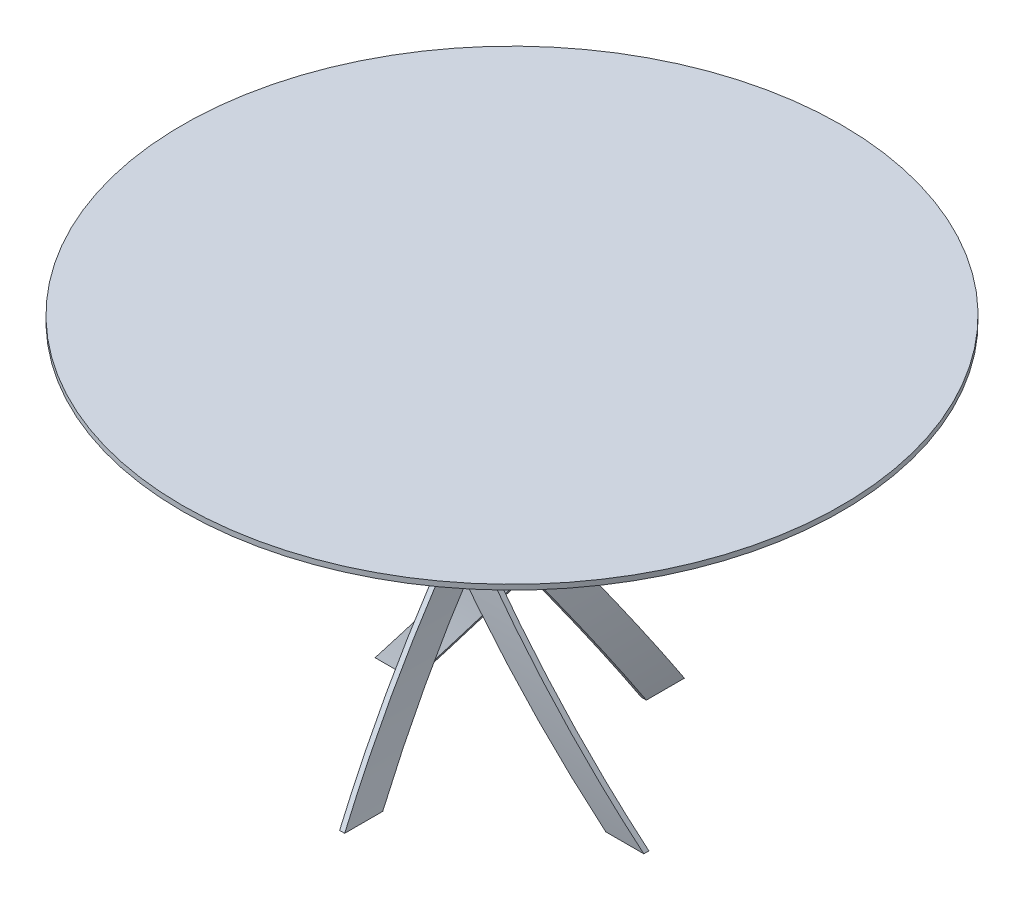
ISO-10303-21;
HEADER;
FILE_DESCRIPTION(('STEP AP214'),'2;1');
FILE_NAME('part.step','',(''),(''),'','','');
FILE_SCHEMA(('AUTOMOTIVE_DESIGN { 1 0 10303 214 1 1 1 1 }'));
ENDSEC;
DATA;
#1=APPLICATION_CONTEXT('core data for automotive mechanical design processes');
#2=APPLICATION_PROTOCOL_DEFINITION('international standard','automotive_design',2000,#1);
#3=PRODUCT_CONTEXT('',#1,'mechanical');
#4=PRODUCT('Part','Part','',(#3));
#5=PRODUCT_RELATED_PRODUCT_CATEGORY('part','',(#4));
#6=PRODUCT_DEFINITION_FORMATION('','',#4);
#7=PRODUCT_DEFINITION_CONTEXT('part definition',#1,'design');
#8=PRODUCT_DEFINITION('design','',#6,#7);
#9=PRODUCT_DEFINITION_SHAPE('','',#8);
#10=(LENGTH_UNIT() NAMED_UNIT(*) SI_UNIT(.MILLI.,.METRE.));
#11=(NAMED_UNIT(*) PLANE_ANGLE_UNIT() SI_UNIT($,.RADIAN.));
#12=(NAMED_UNIT(*) SI_UNIT($,.STERADIAN.) SOLID_ANGLE_UNIT());
#13=UNCERTAINTY_MEASURE_WITH_UNIT(LENGTH_MEASURE(1.E-05),#10,'distance_accuracy_value','');
#14=(GEOMETRIC_REPRESENTATION_CONTEXT(3) GLOBAL_UNCERTAINTY_ASSIGNED_CONTEXT((#13)) GLOBAL_UNIT_ASSIGNED_CONTEXT((#10,
#11,#12)) REPRESENTATION_CONTEXT('',''));
#15=CARTESIAN_POINT('',(0.,0.,0.));
#16=DIRECTION('',(0.,0.,1.));
#17=DIRECTION('',(1.,0.,0.));
#18=AXIS2_PLACEMENT_3D('',#15,#16,#17);
#19=CARTESIAN_POINT('',(-300.000000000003,-1.11022302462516E-13,299.999999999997));
#20=DIRECTION('',(0.,0.589469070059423,0.807790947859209));
#21=DIRECTION('',(0.,-0.807790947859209,0.589469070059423));
#22=AXIS2_PLACEMENT_3D('',#19,#20,#21);
#23=PLANE('',#22);
#24=DIRECTION('',(1.,0.,0.));
#25=VECTOR('',#24,1.);
#26=CARTESIAN_POINT('',(-299.999999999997,740.,-240.000000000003));
#27=LINE('',#26,#25);
#28=CARTESIAN_POINT('',(-39.9999999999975,740.,-240.));
#29=VERTEX_POINT('',#28);
#30=CARTESIAN_POINT('',(-29.9999999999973,740.,-240.));
#31=VERTEX_POINT('',#30);
#32=EDGE_CURVE('E109',#29,#31,#27,.T.);
#33=ORIENTED_EDGE('',*,*,#32,.F.);
#34=CARTESIAN_POINT('',(1721.56180703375,370.,30.0000000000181));
#35=DIRECTION('',(0.,0.589469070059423,0.807790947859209));
#36=DIRECTION('',(0.,0.807790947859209,-0.589469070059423));
#37=AXIS2_PLACEMENT_3D('',#34,#35,#36);
#38=ELLIPSE('',#37,2228.29929546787,1800.);
#39=CARTESIAN_POINT('',(-40.0000000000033,-1.11022302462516E-13,300.));
#40=VERTEX_POINT('',#39);
#41=EDGE_CURVE('E91',#29,#40,#38,.T.);
#42=ORIENTED_EDGE('',*,*,#41,.T.);
#43=DIRECTION('',(1.,0.,0.));
#44=VECTOR('',#43,1.);
#45=CARTESIAN_POINT('',(-300.000000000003,-1.11022302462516E-13,299.999999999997));
#46=LINE('',#45,#44);
#47=CARTESIAN_POINT('',(-30.0000000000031,-1.11022302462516E-13,300.));
#48=VERTEX_POINT('',#47);
#49=EDGE_CURVE('E111',#40,#48,#46,.T.);
#50=ORIENTED_EDGE('',*,*,#49,.T.);
#51=CARTESIAN_POINT('',(1731.56180703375,370.,30.0000000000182));
#52=DIRECTION('',(0.,0.589469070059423,0.807790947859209));
#53=DIRECTION('',(0.,0.807790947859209,-0.589469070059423));
#54=AXIS2_PLACEMENT_3D('',#51,#52,#53);
#55=ELLIPSE('',#54,2228.29929546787,1800.);
#56=EDGE_CURVE('E96',#48,#31,#55,.F.);
#57=ORIENTED_EDGE('',*,*,#56,.T.);
#58=EDGE_LOOP('',(#33,#42,#50,#57));
#59=FACE_BOUND('',#58,.T.);
#60=ADVANCED_FACE('F46',(#59),#23,.T.);
#61=CARTESIAN_POINT('',(1721.56180703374,370.,500.000000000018));
#62=DIRECTION('',(0.,0.,-1.));
#63=DIRECTION('',(-1.,0.,0.));
#64=AXIS2_PLACEMENT_3D('',#61,#62,#63);
#65=CYLINDRICAL_SURFACE('',#64,1800.);
#66=ORIENTED_EDGE('',*,*,#41,.F.);
#67=CARTESIAN_POINT('',(1721.56180703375,370.,-239.999999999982));
#68=DIRECTION('',(0.,0.,-1.));
#69=DIRECTION('',(0.,1.,0.));
#70=AXIS2_PLACEMENT_3D('',#67,#68,#69);
#71=CIRCLE('',#70,1800.);
#72=CARTESIAN_POINT('',(-58.4922044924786,637.222222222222,-240.000000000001));
#73=VERTEX_POINT('',#72);
#74=EDGE_CURVE('E87',#73,#29,#71,.T.);
#75=ORIENTED_EDGE('',*,*,#74,.F.);
#76=CARTESIAN_POINT('',(1721.56180703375,370.,-44.9999999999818));
#77=DIRECTION('',(0.,-0.589469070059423,-0.807790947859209));
#78=DIRECTION('',(0.,0.807790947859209,-0.589469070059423));
#79=AXIS2_PLACEMENT_3D('',#76,#77,#78);
#80=ELLIPSE('',#79,2228.29929546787,1800.);
#81=CARTESIAN_POINT('',(-40.0000000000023,-1.11022302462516E-13,225.));
#82=VERTEX_POINT('',#81);
#83=EDGE_CURVE('E50',#82,#73,#80,.T.);
#84=ORIENTED_EDGE('',*,*,#83,.F.);
#85=DIRECTION('',(0.,0.,-1.));
#86=VECTOR('',#85,1.);
#87=CARTESIAN_POINT('',(-40.0000000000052,0.,500.));
#88=LINE('',#87,#86);
#89=EDGE_CURVE('E70',#40,#82,#88,.T.);
#90=ORIENTED_EDGE('',*,*,#89,.F.);
#91=EDGE_LOOP('',(#66,#75,#84,#90));
#92=FACE_BOUND('',#91,.T.);
#93=ADVANCED_FACE('F89',(#92),#65,.T.);
#94=CARTESIAN_POINT('',(-299.999999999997,637.222222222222,-240.000000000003));
#95=DIRECTION('',(0.,-0.589469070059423,-0.807790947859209));
#96=DIRECTION('',(0.,0.807790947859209,-0.589469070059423));
#97=AXIS2_PLACEMENT_3D('',#94,#95,#96);
#98=PLANE('',#97);
#99=DIRECTION('',(1.,0.,0.));
#100=VECTOR('',#99,1.);
#101=CARTESIAN_POINT('',(-300.000000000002,-1.11022302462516E-13,224.999999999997));
#102=LINE('',#101,#100);
#103=CARTESIAN_POINT('',(-30.0000000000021,-1.11022302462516E-13,225.));
#104=VERTEX_POINT('',#103);
#105=EDGE_CURVE('E12',#82,#104,#102,.T.);
#106=ORIENTED_EDGE('',*,*,#105,.F.);
#107=ORIENTED_EDGE('',*,*,#83,.T.);
#108=DIRECTION('',(1.,0.,0.));
#109=VECTOR('',#108,1.);
#110=CARTESIAN_POINT('',(-299.999999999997,637.222222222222,-240.000000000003));
#111=LINE('',#110,#109);
#112=CARTESIAN_POINT('',(-48.4922044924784,637.222222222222,-240.));
#113=VERTEX_POINT('',#112);
#114=EDGE_CURVE('E55',#73,#113,#111,.T.);
#115=ORIENTED_EDGE('',*,*,#114,.T.);
#116=CARTESIAN_POINT('',(1731.56180703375,370.,-44.9999999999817));
#117=DIRECTION('',(0.,-0.589469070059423,-0.807790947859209));
#118=DIRECTION('',(0.,0.807790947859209,-0.589469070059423));
#119=AXIS2_PLACEMENT_3D('',#116,#117,#118);
#120=ELLIPSE('',#119,2228.29929546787,1800.);
#121=EDGE_CURVE('E101',#113,#104,#120,.F.);
#122=ORIENTED_EDGE('',*,*,#121,.T.);
#123=EDGE_LOOP('',(#106,#107,#115,#122));
#124=FACE_BOUND('',#123,.T.);
#125=ADVANCED_FACE('F48',(#124),#98,.T.);
#126=CARTESIAN_POINT('',(-299.999999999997,740.,-240.000000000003));
#127=DIRECTION('',(0.,0.,-1.));
#128=DIRECTION('',(0.,1.,0.));
#129=AXIS2_PLACEMENT_3D('',#126,#127,#128);
#130=PLANE('',#129);
#131=ORIENTED_EDGE('',*,*,#114,.F.);
#132=ORIENTED_EDGE('',*,*,#74,.T.);
#133=ORIENTED_EDGE('',*,*,#32,.T.);
#134=CARTESIAN_POINT('',(1731.56180703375,370.,-239.999999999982));
#135=DIRECTION('',(0.,0.,-1.));
#136=DIRECTION('',(0.,1.,0.));
#137=AXIS2_PLACEMENT_3D('',#134,#135,#136);
#138=CIRCLE('',#137,1800.);
#139=EDGE_CURVE('E97',#31,#113,#138,.F.);
#140=ORIENTED_EDGE('',*,*,#139,.T.);
#141=EDGE_LOOP('',(#131,#132,#133,#140));
#142=FACE_BOUND('',#141,.T.);
#143=ADVANCED_FACE('F102',(#142),#130,.T.);
#144=CARTESIAN_POINT('',(1731.56180703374,370.,500.000000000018));
#145=DIRECTION('',(0.,0.,-1.));
#146=DIRECTION('',(-1.,0.,0.));
#147=AXIS2_PLACEMENT_3D('',#144,#145,#146);
#148=CYLINDRICAL_SURFACE('',#147,1800.);
#149=ORIENTED_EDGE('',*,*,#56,.F.);
#150=DIRECTION('',(0.,0.,-1.));
#151=VECTOR('',#150,1.);
#152=CARTESIAN_POINT('',(-30.0000000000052,0.,500.));
#153=LINE('',#152,#151);
#154=EDGE_CURVE('E62',#48,#104,#153,.T.);
#155=ORIENTED_EDGE('',*,*,#154,.T.);
#156=ORIENTED_EDGE('',*,*,#121,.F.);
#157=ORIENTED_EDGE('',*,*,#139,.F.);
#158=EDGE_LOOP('',(#149,#155,#156,#157));
#159=FACE_BOUND('',#158,.T.);
#160=ADVANCED_FACE('F122',(#159),#148,.F.);
#161=CARTESIAN_POINT('',(-300.000000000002,-1.11022302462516E-13,224.999999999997));
#162=DIRECTION('',(0.,-1.,0.));
#163=DIRECTION('',(-1.,0.,0.));
#164=AXIS2_PLACEMENT_3D('',#161,#162,#163);
#165=PLANE('',#164);
#166=ORIENTED_EDGE('',*,*,#49,.F.);
#167=ORIENTED_EDGE('',*,*,#89,.T.);
#168=ORIENTED_EDGE('',*,*,#105,.T.);
#169=ORIENTED_EDGE('',*,*,#154,.F.);
#170=EDGE_LOOP('',(#166,#167,#168,#169));
#171=FACE_BOUND('',#170,.T.);
#172=ADVANCED_FACE('F119',(#171),#165,.T.);
#173=CLOSED_SHELL('',(#60,#93,#125,#143,#160,#172));
#174=MANIFOLD_SOLID_BREP('B2',#173);
#175=CARTESIAN_POINT('',(300.,-1.11022302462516E-13,300.));
#176=DIRECTION('',(0.807790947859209,0.589469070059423,0.));
#177=DIRECTION('',(0.589469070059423,-0.807790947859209,0.));
#178=AXIS2_PLACEMENT_3D('',#175,#176,#177);
#179=PLANE('',#178);
#180=DIRECTION('',(0.,0.,-1.));
#181=VECTOR('',#180,1.);
#182=CARTESIAN_POINT('',(-240.,740.,300.));
#183=LINE('',#182,#181);
#184=CARTESIAN_POINT('',(-240.,740.,40.));
#185=VERTEX_POINT('',#184);
#186=CARTESIAN_POINT('',(-240.,740.,29.9999999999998));
#187=VERTEX_POINT('',#186);
#188=EDGE_CURVE('E255',#185,#187,#183,.T.);
#189=ORIENTED_EDGE('',*,*,#188,.F.);
#190=CARTESIAN_POINT('',(30.,370.,-1721.56180703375));
#191=DIRECTION('',(0.807790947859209,0.589469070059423,0.));
#192=DIRECTION('',(-0.589469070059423,0.807790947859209,0.));
#193=AXIS2_PLACEMENT_3D('',#190,#191,#192);
#194=ELLIPSE('',#193,2228.29929546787,1800.);
#195=CARTESIAN_POINT('',(300.,-1.11022302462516E-13,40.0000000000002));
#196=VERTEX_POINT('',#195);
#197=EDGE_CURVE('E237',#185,#196,#194,.T.);
#198=ORIENTED_EDGE('',*,*,#197,.T.);
#199=DIRECTION('',(0.,0.,-1.));
#200=VECTOR('',#199,1.);
#201=CARTESIAN_POINT('',(300.,-1.11022302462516E-13,300.));
#202=LINE('',#201,#200);
#203=CARTESIAN_POINT('',(300.,-1.11022302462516E-13,30.));
#204=VERTEX_POINT('',#203);
#205=EDGE_CURVE('E257',#196,#204,#202,.T.);
#206=ORIENTED_EDGE('',*,*,#205,.T.);
#207=CARTESIAN_POINT('',(30.,370.,-1731.56180703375));
#208=DIRECTION('',(0.807790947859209,0.589469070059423,0.));
#209=DIRECTION('',(-0.589469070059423,0.807790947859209,0.));
#210=AXIS2_PLACEMENT_3D('',#207,#208,#209);
#211=ELLIPSE('',#210,2228.29929546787,1800.);
#212=EDGE_CURVE('E242',#204,#187,#211,.F.);
#213=ORIENTED_EDGE('',*,*,#212,.T.);
#214=EDGE_LOOP('',(#189,#198,#206,#213));
#215=FACE_BOUND('',#214,.T.);
#216=ADVANCED_FACE('F192',(#215),#179,.T.);
#217=CARTESIAN_POINT('',(500.,370.,-1721.56180703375));
#218=DIRECTION('',(-1.,0.,0.));
#219=DIRECTION('',(0.,0.,1.));
#220=AXIS2_PLACEMENT_3D('',#217,#218,#219);
#221=CYLINDRICAL_SURFACE('',#220,1800.);
#222=ORIENTED_EDGE('',*,*,#197,.F.);
#223=CARTESIAN_POINT('',(-240.,370.,-1721.56180703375));
#224=DIRECTION('',(-1.,0.,0.));
#225=DIRECTION('',(0.,1.,0.));
#226=AXIS2_PLACEMENT_3D('',#223,#224,#225);
#227=CIRCLE('',#226,1800.);
#228=CARTESIAN_POINT('',(-240.,637.222222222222,58.4922044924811));
#229=VERTEX_POINT('',#228);
#230=EDGE_CURVE('E233',#229,#185,#227,.T.);
#231=ORIENTED_EDGE('',*,*,#230,.F.);
#232=CARTESIAN_POINT('',(-44.9999999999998,370.,-1721.56180703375));
#233=DIRECTION('',(-0.807790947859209,-0.589469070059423,0.));
#234=DIRECTION('',(-0.589469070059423,0.807790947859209,0.));
#235=AXIS2_PLACEMENT_3D('',#232,#233,#234);
#236=ELLIPSE('',#235,2228.29929546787,1800.);
#237=CARTESIAN_POINT('',(225.,-1.11022302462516E-13,40.));
#238=VERTEX_POINT('',#237);
#239=EDGE_CURVE('E196',#238,#229,#236,.T.);
#240=ORIENTED_EDGE('',*,*,#239,.F.);
#241=DIRECTION('',(-1.,0.,0.));
#242=VECTOR('',#241,1.);
#243=CARTESIAN_POINT('',(500.,0.,40.));
#244=LINE('',#243,#242);
#245=EDGE_CURVE('E216',#196,#238,#244,.T.);
#246=ORIENTED_EDGE('',*,*,#245,.F.);
#247=EDGE_LOOP('',(#222,#231,#240,#246));
#248=FACE_BOUND('',#247,.T.);
#249=ADVANCED_FACE('F235',(#248),#221,.T.);
#250=CARTESIAN_POINT('',(-240.,637.222222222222,300.));
#251=DIRECTION('',(-0.807790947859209,-0.589469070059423,0.));
#252=DIRECTION('',(-0.589469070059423,0.807790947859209,0.));
#253=AXIS2_PLACEMENT_3D('',#250,#251,#252);
#254=PLANE('',#253);
#255=DIRECTION('',(0.,0.,-1.));
#256=VECTOR('',#255,1.);
#257=CARTESIAN_POINT('',(225.,-1.11022302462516E-13,300.));
#258=LINE('',#257,#256);
#259=CARTESIAN_POINT('',(225.,-1.11022302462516E-13,29.9999999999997));
#260=VERTEX_POINT('',#259);
#261=EDGE_CURVE('E44',#238,#260,#258,.T.);
#262=ORIENTED_EDGE('',*,*,#261,.F.);
#263=ORIENTED_EDGE('',*,*,#239,.T.);
#264=DIRECTION('',(0.,0.,-1.));
#265=VECTOR('',#264,1.);
#266=CARTESIAN_POINT('',(-240.,637.222222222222,300.));
#267=LINE('',#266,#265);
#268=CARTESIAN_POINT('',(-240.,637.222222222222,48.4922044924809));
#269=VERTEX_POINT('',#268);
#270=EDGE_CURVE('E201',#229,#269,#267,.T.);
#271=ORIENTED_EDGE('',*,*,#270,.T.);
#272=CARTESIAN_POINT('',(-44.9999999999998,370.,-1731.56180703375));
#273=DIRECTION('',(-0.807790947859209,-0.589469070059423,0.));
#274=DIRECTION('',(-0.589469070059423,0.807790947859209,0.));
#275=AXIS2_PLACEMENT_3D('',#272,#273,#274);
#276=ELLIPSE('',#275,2228.29929546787,1800.);
#277=EDGE_CURVE('E247',#269,#260,#276,.F.);
#278=ORIENTED_EDGE('',*,*,#277,.T.);
#279=EDGE_LOOP('',(#262,#263,#271,#278));
#280=FACE_BOUND('',#279,.T.);
#281=ADVANCED_FACE('F194',(#280),#254,.T.);
#282=CARTESIAN_POINT('',(-240.,740.,300.));
#283=DIRECTION('',(-1.,0.,0.));
#284=DIRECTION('',(0.,1.,0.));
#285=AXIS2_PLACEMENT_3D('',#282,#283,#284);
#286=PLANE('',#285);
#287=ORIENTED_EDGE('',*,*,#270,.F.);
#288=ORIENTED_EDGE('',*,*,#230,.T.);
#289=ORIENTED_EDGE('',*,*,#188,.T.);
#290=CARTESIAN_POINT('',(-240.,370.,-1731.56180703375));
#291=DIRECTION('',(-1.,0.,0.));
#292=DIRECTION('',(0.,1.,0.));
#293=AXIS2_PLACEMENT_3D('',#290,#291,#292);
#294=CIRCLE('',#293,1800.);
#295=EDGE_CURVE('E243',#187,#269,#294,.F.);
#296=ORIENTED_EDGE('',*,*,#295,.T.);
#297=EDGE_LOOP('',(#287,#288,#289,#296));
#298=FACE_BOUND('',#297,.T.);
#299=ADVANCED_FACE('F248',(#298),#286,.T.);
#300=CARTESIAN_POINT('',(500.,370.,-1731.56180703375));
#301=DIRECTION('',(-1.,0.,0.));
#302=DIRECTION('',(0.,0.,1.));
#303=AXIS2_PLACEMENT_3D('',#300,#301,#302);
#304=CYLINDRICAL_SURFACE('',#303,1800.);
#305=ORIENTED_EDGE('',*,*,#212,.F.);
#306=DIRECTION('',(-1.,0.,0.));
#307=VECTOR('',#306,1.);
#308=CARTESIAN_POINT('',(500.,0.,30.));
#309=LINE('',#308,#307);
#310=EDGE_CURVE('E208',#204,#260,#309,.T.);
#311=ORIENTED_EDGE('',*,*,#310,.T.);
#312=ORIENTED_EDGE('',*,*,#277,.F.);
#313=ORIENTED_EDGE('',*,*,#295,.F.);
#314=EDGE_LOOP('',(#305,#311,#312,#313));
#315=FACE_BOUND('',#314,.T.);
#316=ADVANCED_FACE('F268',(#315),#304,.F.);
#317=CARTESIAN_POINT('',(225.,-1.11022302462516E-13,300.));
#318=DIRECTION('',(0.,-1.,0.));
#319=DIRECTION('',(0.,0.,1.));
#320=AXIS2_PLACEMENT_3D('',#317,#318,#319);
#321=PLANE('',#320);
#322=ORIENTED_EDGE('',*,*,#205,.F.);
#323=ORIENTED_EDGE('',*,*,#245,.T.);
#324=ORIENTED_EDGE('',*,*,#261,.T.);
#325=ORIENTED_EDGE('',*,*,#310,.F.);
#326=EDGE_LOOP('',(#322,#323,#324,#325));
#327=FACE_BOUND('',#326,.T.);
#328=ADVANCED_FACE('F265',(#327),#321,.T.);
#329=CLOSED_SHELL('',(#216,#249,#281,#299,#316,#328));
#330=MANIFOLD_SOLID_BREP('B6',#329);
#331=CARTESIAN_POINT('',(300.000000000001,-1.11022302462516E-13,-299.999999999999));
#332=DIRECTION('',(0.,0.589469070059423,-0.807790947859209));
#333=DIRECTION('',(0.,-0.807790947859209,-0.589469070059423));
#334=AXIS2_PLACEMENT_3D('',#331,#332,#333);
#335=PLANE('',#334);
#336=DIRECTION('',(-1.,0.,0.));
#337=VECTOR('',#336,1.);
#338=CARTESIAN_POINT('',(299.999999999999,740.,240.000000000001));
#339=LINE('',#338,#337);
#340=CARTESIAN_POINT('',(39.9999999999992,740.,240.));
#341=VERTEX_POINT('',#340);
#342=CARTESIAN_POINT('',(29.999999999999,740.,240.));
#343=VERTEX_POINT('',#342);
#344=EDGE_CURVE('E401',#341,#343,#339,.T.);
#345=ORIENTED_EDGE('',*,*,#344,.F.);
#346=CARTESIAN_POINT('',(-1721.56180703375,370.,-30.000000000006));
#347=DIRECTION('',(0.,0.589469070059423,-0.807790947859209));
#348=DIRECTION('',(0.,0.807790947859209,0.589469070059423));
#349=AXIS2_PLACEMENT_3D('',#346,#347,#348);
#350=ELLIPSE('',#349,2228.29929546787,1800.);
#351=CARTESIAN_POINT('',(40.0000000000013,-1.11022302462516E-13,-300.));
#352=VERTEX_POINT('',#351);
#353=EDGE_CURVE('E383',#341,#352,#350,.T.);
#354=ORIENTED_EDGE('',*,*,#353,.T.);
#355=DIRECTION('',(-1.,0.,0.));
#356=VECTOR('',#355,1.);
#357=CARTESIAN_POINT('',(300.000000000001,-1.11022302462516E-13,-299.999999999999));
#358=LINE('',#357,#356);
#359=CARTESIAN_POINT('',(30.000000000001,-1.11022302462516E-13,-300.));
#360=VERTEX_POINT('',#359);
#361=EDGE_CURVE('E403',#352,#360,#358,.T.);
#362=ORIENTED_EDGE('',*,*,#361,.T.);
#363=CARTESIAN_POINT('',(-1731.56180703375,370.,-30.0000000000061));
#364=DIRECTION('',(0.,0.589469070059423,-0.807790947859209));
#365=DIRECTION('',(0.,0.807790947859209,0.589469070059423));
#366=AXIS2_PLACEMENT_3D('',#363,#364,#365);
#367=ELLIPSE('',#366,2228.29929546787,1800.);
#368=EDGE_CURVE('E388',#360,#343,#367,.F.);
#369=ORIENTED_EDGE('',*,*,#368,.T.);
#370=EDGE_LOOP('',(#345,#354,#362,#369));
#371=FACE_BOUND('',#370,.T.);
#372=ADVANCED_FACE('F338',(#371),#335,.T.);
#373=CARTESIAN_POINT('',(-1721.56180703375,370.,-500.000000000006));
#374=DIRECTION('',(0.,0.,1.));
#375=DIRECTION('',(1.,0.,0.));
#376=AXIS2_PLACEMENT_3D('',#373,#374,#375);
#377=CYLINDRICAL_SURFACE('',#376,1800.);
#378=ORIENTED_EDGE('',*,*,#353,.F.);
#379=CARTESIAN_POINT('',(-1721.56180703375,370.,239.999999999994));
#380=DIRECTION('',(0.,0.,1.));
#381=DIRECTION('',(0.,1.,0.));
#382=AXIS2_PLACEMENT_3D('',#379,#380,#381);
#383=CIRCLE('',#382,1800.);
#384=CARTESIAN_POINT('',(58.4922044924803,637.222222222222,240.));
#385=VERTEX_POINT('',#384);
#386=EDGE_CURVE('E379',#385,#341,#383,.T.);
#387=ORIENTED_EDGE('',*,*,#386,.F.);
#388=CARTESIAN_POINT('',(-1721.56180703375,370.,44.9999999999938));
#389=DIRECTION('',(0.,-0.589469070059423,0.807790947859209));
#390=DIRECTION('',(0.,0.807790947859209,0.589469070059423));
#391=AXIS2_PLACEMENT_3D('',#388,#389,#390);
#392=ELLIPSE('',#391,2228.29929546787,1800.);
#393=CARTESIAN_POINT('',(40.0000000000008,-1.11022302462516E-13,-225.));
#394=VERTEX_POINT('',#393);
#395=EDGE_CURVE('E342',#394,#385,#392,.T.);
#396=ORIENTED_EDGE('',*,*,#395,.F.);
#397=DIRECTION('',(0.,0.,1.));
#398=VECTOR('',#397,1.);
#399=CARTESIAN_POINT('',(40.0000000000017,0.,-500.));
#400=LINE('',#399,#398);
#401=EDGE_CURVE('E362',#352,#394,#400,.T.);
#402=ORIENTED_EDGE('',*,*,#401,.F.);
#403=EDGE_LOOP('',(#378,#387,#396,#402));
#404=FACE_BOUND('',#403,.T.);
#405=ADVANCED_FACE('F381',(#404),#377,.T.);
#406=CARTESIAN_POINT('',(299.999999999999,637.222222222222,240.000000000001));
#407=DIRECTION('',(0.,-0.589469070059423,0.807790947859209));
#408=DIRECTION('',(0.,0.807790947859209,0.589469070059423));
#409=AXIS2_PLACEMENT_3D('',#406,#407,#408);
#410=PLANE('',#409);
#411=DIRECTION('',(-1.,0.,0.));
#412=VECTOR('',#411,1.);
#413=CARTESIAN_POINT('',(300.000000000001,-1.11022302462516E-13,-224.999999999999));
#414=LINE('',#413,#412);
#415=CARTESIAN_POINT('',(30.0000000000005,-1.11022302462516E-13,-225.));
#416=VERTEX_POINT('',#415);
#417=EDGE_CURVE('E190',#394,#416,#414,.T.);
#418=ORIENTED_EDGE('',*,*,#417,.F.);
#419=ORIENTED_EDGE('',*,*,#395,.T.);
#420=DIRECTION('',(-1.,0.,0.));
#421=VECTOR('',#420,1.);
#422=CARTESIAN_POINT('',(299.999999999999,637.222222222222,240.000000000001));
#423=LINE('',#422,#421);
#424=CARTESIAN_POINT('',(48.49220449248,637.222222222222,240.));
#425=VERTEX_POINT('',#424);
#426=EDGE_CURVE('E347',#385,#425,#423,.T.);
#427=ORIENTED_EDGE('',*,*,#426,.T.);
#428=CARTESIAN_POINT('',(-1731.56180703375,370.,44.9999999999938));
#429=DIRECTION('',(0.,-0.589469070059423,0.807790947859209));
#430=DIRECTION('',(0.,0.807790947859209,0.589469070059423));
#431=AXIS2_PLACEMENT_3D('',#428,#429,#430);
#432=ELLIPSE('',#431,2228.29929546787,1800.);
#433=EDGE_CURVE('E393',#425,#416,#432,.F.);
#434=ORIENTED_EDGE('',*,*,#433,.T.);
#435=EDGE_LOOP('',(#418,#419,#427,#434));
#436=FACE_BOUND('',#435,.T.);
#437=ADVANCED_FACE('F340',(#436),#410,.T.);
#438=CARTESIAN_POINT('',(299.999999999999,740.,240.000000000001));
#439=DIRECTION('',(0.,0.,1.));
#440=DIRECTION('',(0.,1.,0.));
#441=AXIS2_PLACEMENT_3D('',#438,#439,#440);
#442=PLANE('',#441);
#443=ORIENTED_EDGE('',*,*,#426,.F.);
#444=ORIENTED_EDGE('',*,*,#386,.T.);
#445=ORIENTED_EDGE('',*,*,#344,.T.);
#446=CARTESIAN_POINT('',(-1731.56180703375,370.,239.999999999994));
#447=DIRECTION('',(0.,0.,1.));
#448=DIRECTION('',(0.,1.,0.));
#449=AXIS2_PLACEMENT_3D('',#446,#447,#448);
#450=CIRCLE('',#449,1800.);
#451=EDGE_CURVE('E389',#343,#425,#450,.F.);
#452=ORIENTED_EDGE('',*,*,#451,.T.);
#453=EDGE_LOOP('',(#443,#444,#445,#452));
#454=FACE_BOUND('',#453,.T.);
#455=ADVANCED_FACE('F394',(#454),#442,.T.);
#456=CARTESIAN_POINT('',(-1731.56180703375,370.,-500.000000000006));
#457=DIRECTION('',(0.,0.,1.));
#458=DIRECTION('',(1.,0.,0.));
#459=AXIS2_PLACEMENT_3D('',#456,#457,#458);
#460=CYLINDRICAL_SURFACE('',#459,1800.);
#461=ORIENTED_EDGE('',*,*,#368,.F.);
#462=DIRECTION('',(0.,0.,1.));
#463=VECTOR('',#462,1.);
#464=CARTESIAN_POINT('',(30.0000000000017,0.,-500.));
#465=LINE('',#464,#463);
#466=EDGE_CURVE('E354',#360,#416,#465,.T.);
#467=ORIENTED_EDGE('',*,*,#466,.T.);
#468=ORIENTED_EDGE('',*,*,#433,.F.);
#469=ORIENTED_EDGE('',*,*,#451,.F.);
#470=EDGE_LOOP('',(#461,#467,#468,#469));
#471=FACE_BOUND('',#470,.T.);
#472=ADVANCED_FACE('F414',(#471),#460,.F.);
#473=CARTESIAN_POINT('',(300.000000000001,-1.11022302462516E-13,-224.999999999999));
#474=DIRECTION('',(0.,-1.,0.));
#475=DIRECTION('',(1.,0.,0.));
#476=AXIS2_PLACEMENT_3D('',#473,#474,#475);
#477=PLANE('',#476);
#478=ORIENTED_EDGE('',*,*,#361,.F.);
#479=ORIENTED_EDGE('',*,*,#401,.T.);
#480=ORIENTED_EDGE('',*,*,#417,.T.);
#481=ORIENTED_EDGE('',*,*,#466,.F.);
#482=EDGE_LOOP('',(#478,#479,#480,#481));
#483=FACE_BOUND('',#482,.T.);
#484=ADVANCED_FACE('F411',(#483),#477,.T.);
#485=CLOSED_SHELL('',(#372,#405,#437,#455,#472,#484));
#486=MANIFOLD_SOLID_BREP('B38',#485);
#487=CARTESIAN_POINT('',(-300.,-1.11022302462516E-13,-300.));
#488=DIRECTION('',(-0.807790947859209,0.589469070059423,0.));
#489=DIRECTION('',(-0.589469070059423,-0.807790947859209,0.));
#490=AXIS2_PLACEMENT_3D('',#487,#488,#489);
#491=PLANE('',#490);
#492=DIRECTION('',(0.,0.,1.));
#493=VECTOR('',#492,1.);
#494=CARTESIAN_POINT('',(240.,740.,-300.));
#495=LINE('',#494,#493);
#496=CARTESIAN_POINT('',(240.,740.,-40.));
#497=VERTEX_POINT('',#496);
#498=CARTESIAN_POINT('',(240.,740.,-29.9999999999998));
#499=VERTEX_POINT('',#498);
#500=EDGE_CURVE('E544',#497,#499,#495,.T.);
#501=ORIENTED_EDGE('',*,*,#500,.F.);
#502=CARTESIAN_POINT('',(-30.,370.,1721.56180703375));
#503=DIRECTION('',(-0.807790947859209,0.589469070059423,0.));
#504=DIRECTION('',(0.589469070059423,0.807790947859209,0.));
#505=AXIS2_PLACEMENT_3D('',#502,#503,#504);
#506=ELLIPSE('',#505,2228.29929546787,1800.);
#507=CARTESIAN_POINT('',(-300.,-1.11022302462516E-13,-40.0000000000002));
#508=VERTEX_POINT('',#507);
#509=EDGE_CURVE('E526',#497,#508,#506,.T.);
#510=ORIENTED_EDGE('',*,*,#509,.T.);
#511=DIRECTION('',(0.,0.,1.));
#512=VECTOR('',#511,1.);
#513=CARTESIAN_POINT('',(-300.,-1.11022302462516E-13,-300.));
#514=LINE('',#513,#512);
#515=CARTESIAN_POINT('',(-300.,-1.11022302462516E-13,-30.));
#516=VERTEX_POINT('',#515);
#517=EDGE_CURVE('E546',#508,#516,#514,.T.);
#518=ORIENTED_EDGE('',*,*,#517,.T.);
#519=CARTESIAN_POINT('',(-30.,370.,1731.56180703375));
#520=DIRECTION('',(-0.807790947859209,0.589469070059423,0.));
#521=DIRECTION('',(0.589469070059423,0.807790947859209,0.));
#522=AXIS2_PLACEMENT_3D('',#519,#520,#521);
#523=ELLIPSE('',#522,2228.29929546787,1800.);
#524=EDGE_CURVE('E531',#516,#499,#523,.F.);
#525=ORIENTED_EDGE('',*,*,#524,.T.);
#526=EDGE_LOOP('',(#501,#510,#518,#525));
#527=FACE_BOUND('',#526,.T.);
#528=ADVANCED_FACE('F481',(#527),#491,.T.);
#529=CARTESIAN_POINT('',(-500.,370.,1721.56180703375));
#530=DIRECTION('',(1.,0.,0.));
#531=DIRECTION('',(0.,0.,-1.));
#532=AXIS2_PLACEMENT_3D('',#529,#530,#531);
#533=CYLINDRICAL_SURFACE('',#532,1800.);
#534=ORIENTED_EDGE('',*,*,#509,.F.);
#535=CARTESIAN_POINT('',(240.,370.,1721.56180703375));
#536=DIRECTION('',(1.,0.,0.));
#537=DIRECTION('',(0.,1.,0.));
#538=AXIS2_PLACEMENT_3D('',#535,#536,#537);
#539=CIRCLE('',#538,1800.);
#540=CARTESIAN_POINT('',(240.,637.222222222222,-58.4922044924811));
#541=VERTEX_POINT('',#540);
#542=EDGE_CURVE('E522',#541,#497,#539,.T.);
#543=ORIENTED_EDGE('',*,*,#542,.F.);
#544=CARTESIAN_POINT('',(44.9999999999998,370.,1721.56180703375));
#545=DIRECTION('',(0.807790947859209,-0.589469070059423,0.));
#546=DIRECTION('',(0.589469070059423,0.807790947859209,0.));
#547=AXIS2_PLACEMENT_3D('',#544,#545,#546);
#548=ELLIPSE('',#547,2228.29929546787,1800.);
#549=CARTESIAN_POINT('',(-225.,-1.11022302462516E-13,-40.));
#550=VERTEX_POINT('',#549);
#551=EDGE_CURVE('E485',#550,#541,#548,.T.);
#552=ORIENTED_EDGE('',*,*,#551,.F.);
#553=DIRECTION('',(1.,0.,0.));
#554=VECTOR('',#553,1.);
#555=CARTESIAN_POINT('',(-500.,0.,-40.));
#556=LINE('',#555,#554);
#557=EDGE_CURVE('E505',#508,#550,#556,.T.);
#558=ORIENTED_EDGE('',*,*,#557,.F.);
#559=EDGE_LOOP('',(#534,#543,#552,#558));
#560=FACE_BOUND('',#559,.T.);
#561=ADVANCED_FACE('F524',(#560),#533,.T.);
#562=CARTESIAN_POINT('',(240.,637.222222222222,-300.));
#563=DIRECTION('',(0.807790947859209,-0.589469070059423,0.));
#564=DIRECTION('',(0.589469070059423,0.807790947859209,0.));
#565=AXIS2_PLACEMENT_3D('',#562,#563,#564);
#566=PLANE('',#565);
#567=DIRECTION('',(0.,0.,1.));
#568=VECTOR('',#567,1.);
#569=CARTESIAN_POINT('',(-225.,-1.11022302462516E-13,-300.));
#570=LINE('',#569,#568);
#571=CARTESIAN_POINT('',(-225.,-1.11022302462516E-13,-29.9999999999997));
#572=VERTEX_POINT('',#571);
#573=EDGE_CURVE('E336',#550,#572,#570,.T.);
#574=ORIENTED_EDGE('',*,*,#573,.F.);
#575=ORIENTED_EDGE('',*,*,#551,.T.);
#576=DIRECTION('',(0.,0.,1.));
#577=VECTOR('',#576,1.);
#578=CARTESIAN_POINT('',(240.,637.222222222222,-300.));
#579=LINE('',#578,#577);
#580=CARTESIAN_POINT('',(240.,637.222222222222,-48.4922044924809));
#581=VERTEX_POINT('',#580);
#582=EDGE_CURVE('E490',#541,#581,#579,.T.);
#583=ORIENTED_EDGE('',*,*,#582,.T.);
#584=CARTESIAN_POINT('',(44.9999999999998,370.,1731.56180703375));
#585=DIRECTION('',(0.807790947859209,-0.589469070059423,0.));
#586=DIRECTION('',(0.589469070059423,0.807790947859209,0.));
#587=AXIS2_PLACEMENT_3D('',#584,#585,#586);
#588=ELLIPSE('',#587,2228.29929546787,1800.);
#589=EDGE_CURVE('E536',#581,#572,#588,.F.);
#590=ORIENTED_EDGE('',*,*,#589,.T.);
#591=EDGE_LOOP('',(#574,#575,#583,#590));
#592=FACE_BOUND('',#591,.T.);
#593=ADVANCED_FACE('F483',(#592),#566,.T.);
#594=CARTESIAN_POINT('',(240.,740.,-300.));
#595=DIRECTION('',(1.,0.,0.));
#596=DIRECTION('',(0.,1.,0.));
#597=AXIS2_PLACEMENT_3D('',#594,#595,#596);
#598=PLANE('',#597);
#599=ORIENTED_EDGE('',*,*,#582,.F.);
#600=ORIENTED_EDGE('',*,*,#542,.T.);
#601=ORIENTED_EDGE('',*,*,#500,.T.);
#602=CARTESIAN_POINT('',(240.,370.,1731.56180703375));
#603=DIRECTION('',(1.,0.,0.));
#604=DIRECTION('',(0.,1.,0.));
#605=AXIS2_PLACEMENT_3D('',#602,#603,#604);
#606=CIRCLE('',#605,1800.);
#607=EDGE_CURVE('E532',#499,#581,#606,.F.);
#608=ORIENTED_EDGE('',*,*,#607,.T.);
#609=EDGE_LOOP('',(#599,#600,#601,#608));
#610=FACE_BOUND('',#609,.T.);
#611=ADVANCED_FACE('F537',(#610),#598,.T.);
#612=CARTESIAN_POINT('',(-500.,370.,1731.56180703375));
#613=DIRECTION('',(1.,0.,0.));
#614=DIRECTION('',(0.,0.,-1.));
#615=AXIS2_PLACEMENT_3D('',#612,#613,#614);
#616=CYLINDRICAL_SURFACE('',#615,1800.);
#617=ORIENTED_EDGE('',*,*,#524,.F.);
#618=DIRECTION('',(1.,0.,0.));
#619=VECTOR('',#618,1.);
#620=CARTESIAN_POINT('',(-500.,0.,-30.));
#621=LINE('',#620,#619);
#622=EDGE_CURVE('E497',#516,#572,#621,.T.);
#623=ORIENTED_EDGE('',*,*,#622,.T.);
#624=ORIENTED_EDGE('',*,*,#589,.F.);
#625=ORIENTED_EDGE('',*,*,#607,.F.);
#626=EDGE_LOOP('',(#617,#623,#624,#625));
#627=FACE_BOUND('',#626,.T.);
#628=ADVANCED_FACE('F557',(#627),#616,.F.);
#629=CARTESIAN_POINT('',(-225.,-1.11022302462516E-13,-300.));
#630=DIRECTION('',(0.,-1.,0.));
#631=DIRECTION('',(0.,0.,-1.));
#632=AXIS2_PLACEMENT_3D('',#629,#630,#631);
#633=PLANE('',#632);
#634=ORIENTED_EDGE('',*,*,#517,.F.);
#635=ORIENTED_EDGE('',*,*,#557,.T.);
#636=ORIENTED_EDGE('',*,*,#573,.T.);
#637=ORIENTED_EDGE('',*,*,#622,.F.);
#638=EDGE_LOOP('',(#634,#635,#636,#637));
#639=FACE_BOUND('',#638,.T.);
#640=ADVANCED_FACE('F554',(#639),#633,.T.);
#641=CLOSED_SHELL('',(#528,#561,#593,#611,#628,#640));
#642=MANIFOLD_SOLID_BREP('B184',#641);
#643=CARTESIAN_POINT('',(0.,750.,0.));
#644=DIRECTION('',(0.,-1.,0.));
#645=DIRECTION('',(0.,0.,-1.));
#646=AXIS2_PLACEMENT_3D('',#643,#644,#645);
#647=CYLINDRICAL_SURFACE('',#646,650.);
#648=CARTESIAN_POINT('',(0.,750.,0.));
#649=DIRECTION('',(0.,1.,0.));
#650=DIRECTION('',(0.,0.,1.));
#651=AXIS2_PLACEMENT_3D('',#648,#649,#650);
#652=CIRCLE('',#651,650.);
#653=CARTESIAN_POINT('',(0.,750.,650.));
#654=VERTEX_POINT('',#653);
#655=EDGE_CURVE('E480',#654,#654,#652,.T.);
#656=ORIENTED_EDGE('',*,*,#655,.F.);
#657=EDGE_LOOP('',(#656));
#658=FACE_BOUND('',#657,.T.);
#659=CARTESIAN_POINT('',(0.,740.,0.));
#660=DIRECTION('',(0.,1.,0.));
#661=DIRECTION('',(0.,0.,1.));
#662=AXIS2_PLACEMENT_3D('',#659,#660,#661);
#663=CIRCLE('',#662,650.);
#664=CARTESIAN_POINT('',(0.,740.,650.));
#665=VERTEX_POINT('',#664);
#666=EDGE_CURVE('E608',#665,#665,#663,.T.);
#667=ORIENTED_EDGE('',*,*,#666,.T.);
#668=EDGE_LOOP('',(#667));
#669=FACE_BOUND('',#668,.T.);
#670=ADVANCED_FACE('F605',(#658,#669),#647,.T.);
#671=CARTESIAN_POINT('',(0.,750.,0.));
#672=DIRECTION('',(0.,1.,0.));
#673=DIRECTION('',(0.,0.,1.));
#674=AXIS2_PLACEMENT_3D('',#671,#672,#673);
#675=PLANE('',#674);
#676=ORIENTED_EDGE('',*,*,#655,.T.);
#677=EDGE_LOOP('',(#676));
#678=FACE_BOUND('',#677,.T.);
#679=ADVANCED_FACE('F620',(#678),#675,.T.);
#680=CARTESIAN_POINT('',(0.,740.,0.));
#681=DIRECTION('',(0.,1.,0.));
#682=DIRECTION('',(0.,0.,1.));
#683=AXIS2_PLACEMENT_3D('',#680,#681,#682);
#684=PLANE('',#683);
#685=ORIENTED_EDGE('',*,*,#666,.F.);
#686=EDGE_LOOP('',(#685));
#687=FACE_BOUND('',#686,.T.);
#688=ADVANCED_FACE('F618',(#687),#684,.F.);
#689=CLOSED_SHELL('',(#670,#679,#688));
#690=MANIFOLD_SOLID_BREP('B330',#689);
#691=ADVANCED_BREP_SHAPE_REPRESENTATION('',(#18,#174,#330,#486,#642,#690),#14);
#692=SHAPE_DEFINITION_REPRESENTATION(#9,#691);
ENDSEC;
END-ISO-10303-21;
